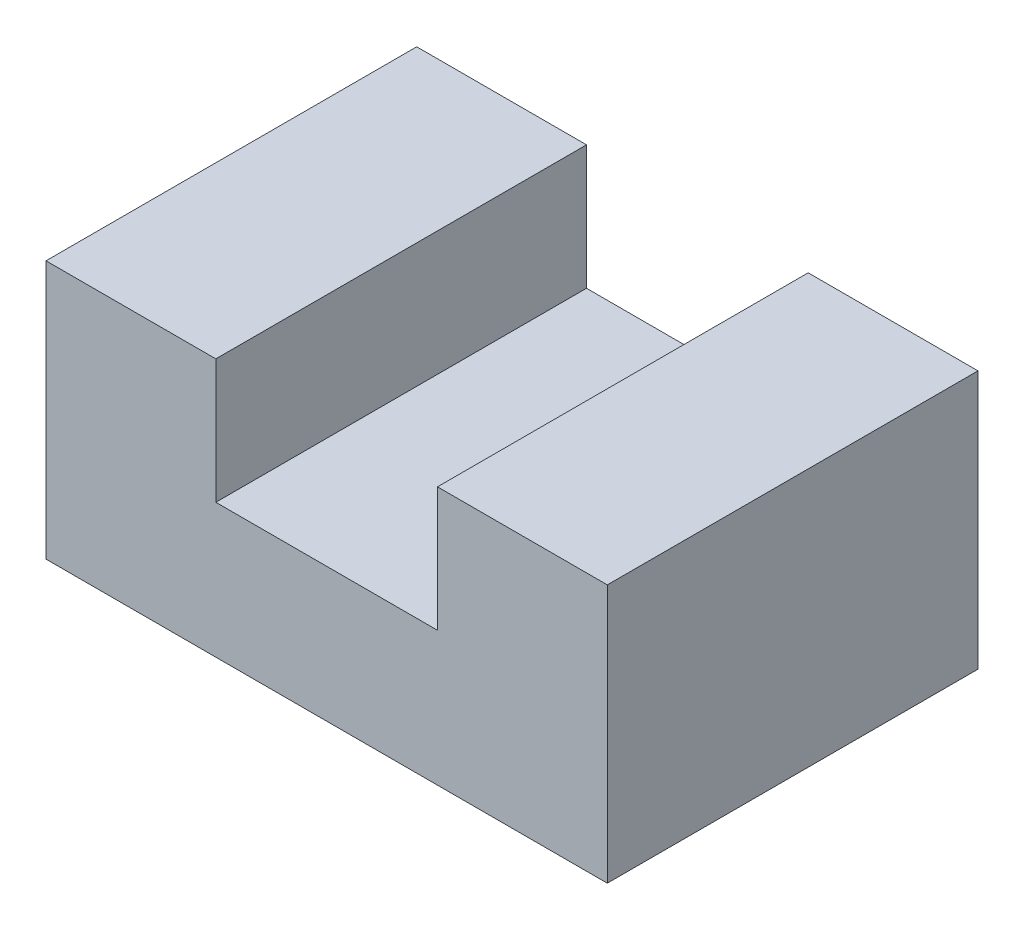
from build123d import *

# Parameters (mm, degrees)
EXTRUDE1_DEPTH = 55


with BuildPart() as part:
    # Sketch1 → Extrude1 (new, symmetric)
    with BuildSketch(Plane.XY):
        Polygon((-83.279638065, 0), (83.279638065, 0), (83.279638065, 76.670803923), (32.888360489, 76.670803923), (32.888360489, 39.806887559), (-32.888360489, 39.806887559), (-32.888360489, 76.670803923), (-83.279638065, 76.670803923), align=None)
    extrude(amount=EXTRUDE1_DEPTH, both=True)


solid = part.part
